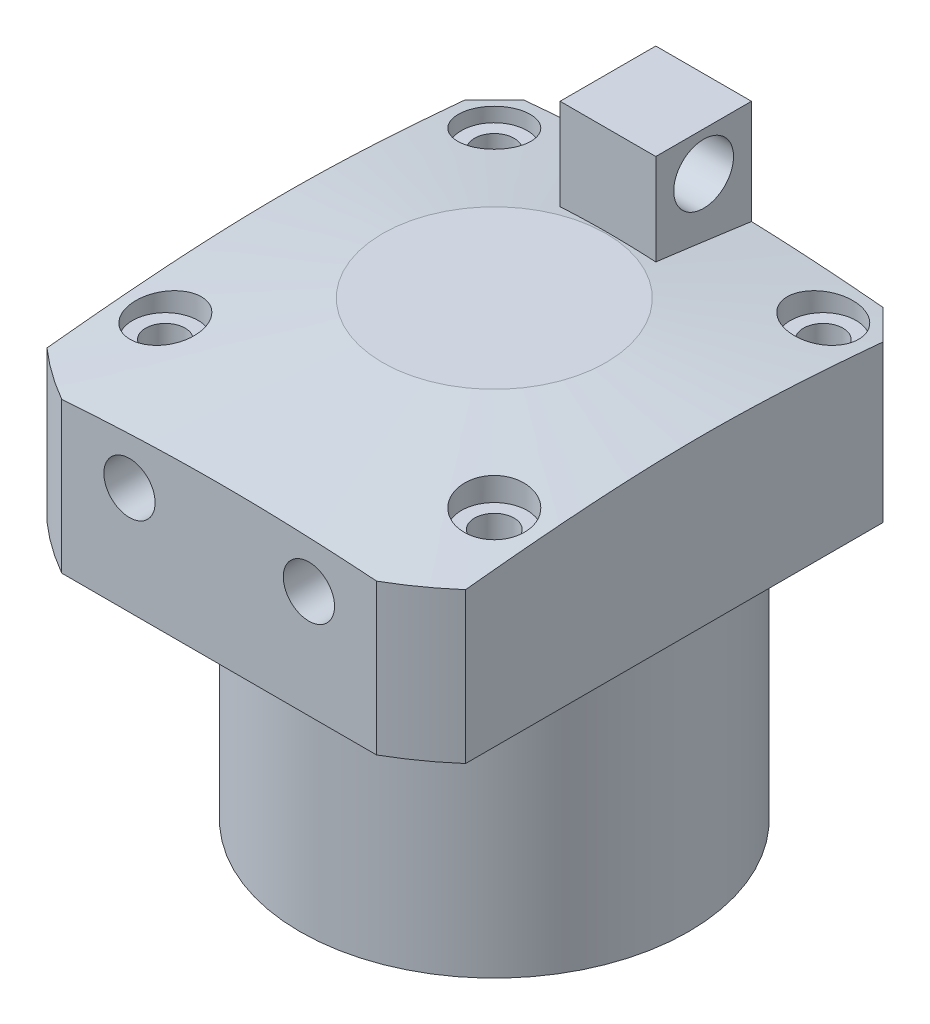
from build123d import *

# Parameters (mm, degrees)
SKETCH2_OUTSIDE_W                            = 141.57
SKETCH2_OUTSIDE_H                            = 141.57
SKETCH2_OUTSIDE_W_2                          = 70
SKETCH2_OUTSIDE_H_2                          = 81
CUT_EXTRUDE2_DEPTH                           = 107.387264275
CHAMFER1_SIZE                                = 5
G1_8_TAPPED_HOLE1_D                          = 8.566
G1_8_TAPPED_HOLE1_DEPTH                      = 22.18
CBORE_FOR_M6_HEX_SOCKET_HEAD_CAP_SCR_2_COUNT = 2
CBORE_FOR_M6_HEX_SOCKET_HEAD_CAP_SCR_2_PITCH = 55
CBORE_FOR_M6_HEX_SOCKET_HEAD_CAP_SCR_3_COUNT = 2
CBORE_FOR_M6_HEX_SOCKET_HEAD_CAP_SCR_3_PITCH = 77.781745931
CBORE_FOR_M6_HEX_SOCKET_HEAD_CAP_SCR_4_COUNT = 2
CBORE_FOR_M6_HEX_SOCKET_HEAD_CAP_SCR_4_PITCH = 55
F_8_0_8_DIAMETER_HOLE2_D                     = 8
F_8_0_8_DIAMETER_HOLE2_DEPTH                 = 1.5
SKETCH13_W                                   = 16
SKETCH13_H                                   = 16
BOSS_EXTRUDE1_DEPTH                          = 15
BOSS_EXTRUDE1_DIRECTION_2_REACH              = 97.085
SKETCH14_R                                   = 5
CUT_EXTRUDE3_DEPTH                           = 16


with BuildPart() as part:
    # Sketch1 → Revolve1 (revolve)
    with BuildSketch(Plane.XY, mode=Mode.PRIVATE) as revolve1_sk:
        Polygon((0, 0), (-32.5, 0), (-32.5, 45.5), (-53, 45.5), (-53, 70.677767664), (-18.688034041, 75.5), (0, 75.5), align=None)
    revolve(revolve1_sk.sketch.rotate(Axis((0, 87.050829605, 0), (0, -1, 0)), 270), axis=Axis((0, 87.050829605, 0), (0, -1, 0)))

    # Sketch2 outside → Cut-Extrude2 (cut, through all)
    with BuildSketch(Plane(origin=(0, 75.5, 0), x_dir=(1, 0, 0), z_dir=(0, 1, 0))):
        Rectangle(SKETCH2_OUTSIDE_W, SKETCH2_OUTSIDE_H)
        with Locations((0, -5.5)):
            Rectangle(SKETCH2_OUTSIDE_W_2, SKETCH2_OUTSIDE_H_2, mode=Mode.SUBTRACT)
    extrude(amount=-CUT_EXTRUDE2_DEPTH, mode=Mode.SUBTRACT)

    # Chamfer1
    chamfer1_edges = [part.edges().sort_by_distance(p)[0] for p in [
        (35, 58.335007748, -35),
        (-35, 58.335007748, -35),
    ]]
    chamfer(chamfer1_edges, length=CHAMFER1_SIZE)

    # G1_8 Tapped Hole1
    with Locations(Plane.XY.offset(46)):
        with Locations((-15, 63.5), (15, 63.5)):
            Hole(G1_8_TAPPED_HOLE1_D / 2, depth=G1_8_TAPPED_HOLE1_DEPTH)

    # Sketch9 → CBORE for M6 Hex Socket Head Cap Screw2 (revolve, cut)
    with BuildSketch(Plane(origin=(-27.5, 75.5, -27.5), x_dir=(0, 0, 1), z_dir=(1, 0, 0))):
        Polygon((0, 0), (0, 30), (3.325, 30), (3.3, 29.975), (3.3, 6), (5.5, 6), (5.5, 0), align=None)
    cbore_for_m6_hex_socket_head_cap_screw2 = revolve(axis=Axis((-27.5, 81.85, -27.5), (0, -1, 0)), mode=Mode.SUBTRACT)

    # CBORE for M6 Hex Socket Head Cap Scr 2: CBORE for M6 Hex Socket Head Cap Screw2 ×2
    with Locations(*[(i * CBORE_FOR_M6_HEX_SOCKET_HEAD_CAP_SCR_2_PITCH, 0, 0) for i in range(1, CBORE_FOR_M6_HEX_SOCKET_HEAD_CAP_SCR_2_COUNT)]):
        add(cbore_for_m6_hex_socket_head_cap_screw2, mode=Mode.SUBTRACT)

    # CBORE for M6 Hex Socket Head Cap Scr 3: CBORE for M6 Hex Socket Head Cap Screw2 ×2
    with Locations(*[Vector(0.7071067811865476, 0, 0.7071067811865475) * (i * CBORE_FOR_M6_HEX_SOCKET_HEAD_CAP_SCR_3_PITCH) for i in range(1, CBORE_FOR_M6_HEX_SOCKET_HEAD_CAP_SCR_3_COUNT)]):
        add(cbore_for_m6_hex_socket_head_cap_screw2, mode=Mode.SUBTRACT)

    # CBORE for M6 Hex Socket Head Cap Scr 4: CBORE for M6 Hex Socket Head Cap Screw2 ×2
    with Locations(*[(0, 0, i * CBORE_FOR_M6_HEX_SOCKET_HEAD_CAP_SCR_4_PITCH) for i in range(1, CBORE_FOR_M6_HEX_SOCKET_HEAD_CAP_SCR_4_COUNT)]):
        add(cbore_for_m6_hex_socket_head_cap_screw2, mode=Mode.SUBTRACT)

    # 8.0 _8_ Diameter Hole2
    with Locations(Plane.XZ.offset(-45.5)):
        with Locations((-15, 39.5), (15, 39.5)):
            Hole(F_8_0_8_DIAMETER_HOLE2_D / 2, depth=F_8_0_8_DIAMETER_HOLE2_DEPTH)


with BuildPart() as body_2:
    # Sketch13 → Boss-Extrude1 (new body)
    with BuildSketch(Plane(origin=(0, 75.5, 0), x_dir=(-1, 0, 0), z_dir=(0, 1, 0))):
        with Locations((0, -27)):
            Rectangle(SKETCH13_W, SKETCH13_H)
    extrude(amount=BOSS_EXTRUDE1_DEPTH)

    # Boss-Extrude1 direction 2: up to this cone (the profile starts outside it)
    boss_extrude1_direction_2_end = Plane(origin=(0, 75.5, 0), z_dir=(0, -1, 0)).offset(-2.626430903) * Cone(7.115e-06, 846.01365999, 118.899464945, align=(Align.CENTER, Align.CENTER, Align.MIN), mode=Mode.PRIVATE)
    # Sketch13 → Boss-Extrude1 direction 2 (add, up to the surface)
    with BuildSketch(Plane(origin=(0, 75.5, 0), x_dir=(-1, 0, 0), z_dir=(0, 1, 0)), mode=Mode.PRIVATE) as boss_extrude1_direction_2_sk1:
        with Locations((0, -27)):
            Rectangle(SKETCH13_W, SKETCH13_H)
    boss_extrude1_direction_2_tool1 = extrude(boss_extrude1_direction_2_sk1.sketch, amount=-BOSS_EXTRUDE1_DIRECTION_2_REACH, mode=Mode.PRIVATE) - boss_extrude1_direction_2_end
    add(boss_extrude1_direction_2_tool1.solids().sort_by_distance((0, 75.5, -27))[0])

    # Sketch14 → Cut-Extrude3 (cut)
    with BuildSketch(Plane(origin=(8, 0, 0), x_dir=(0, 0, -1), z_dir=(1, 0, 0))):
        with Locations((27, 84)):
            Circle(SKETCH14_R)
    extrude(amount=-CUT_EXTRUDE3_DEPTH, mode=Mode.SUBTRACT)


solid = Compound([part.part, body_2.part])
